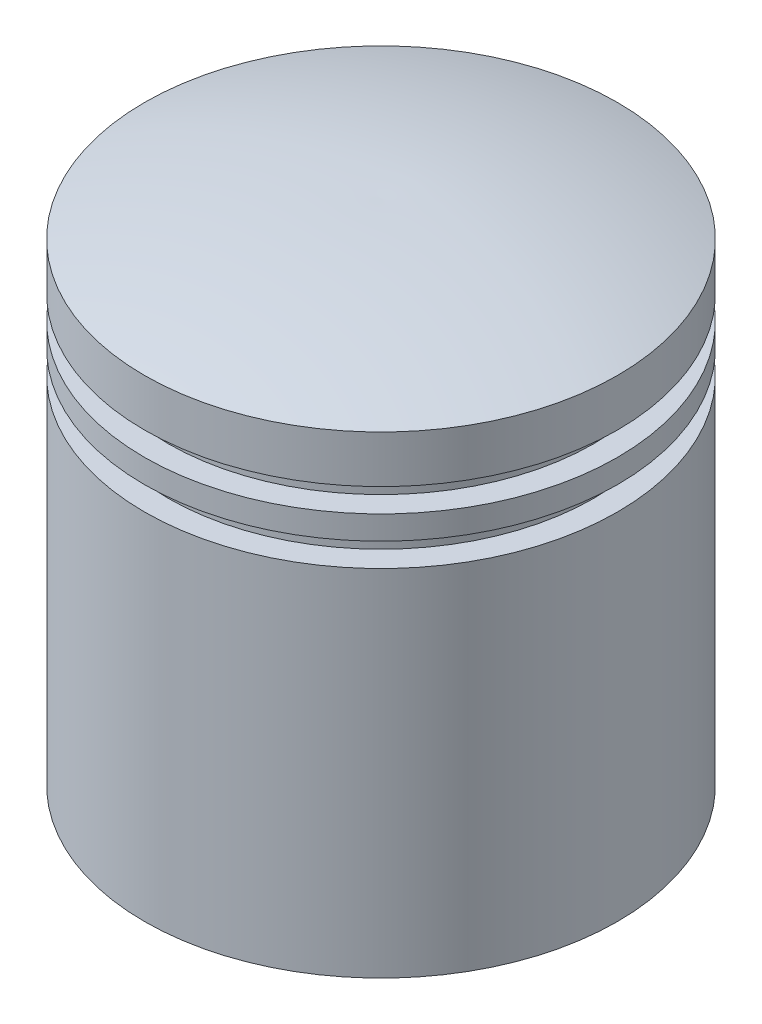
ISO-10303-21;
HEADER;
FILE_DESCRIPTION(('STEP AP214'),'2;1');
FILE_NAME('part.step','',(''),(''),'','','');
FILE_SCHEMA(('AUTOMOTIVE_DESIGN { 1 0 10303 214 1 1 1 1 }'));
ENDSEC;
DATA;
#1=APPLICATION_CONTEXT('core data for automotive mechanical design processes');
#2=APPLICATION_PROTOCOL_DEFINITION('international standard','automotive_design',2000,#1);
#3=PRODUCT_CONTEXT('',#1,'mechanical');
#4=PRODUCT('Part','Part','',(#3));
#5=PRODUCT_RELATED_PRODUCT_CATEGORY('part','',(#4));
#6=PRODUCT_DEFINITION_FORMATION('','',#4);
#7=PRODUCT_DEFINITION_CONTEXT('part definition',#1,'design');
#8=PRODUCT_DEFINITION('design','',#6,#7);
#9=PRODUCT_DEFINITION_SHAPE('','',#8);
#10=(LENGTH_UNIT() NAMED_UNIT(*) SI_UNIT(.MILLI.,.METRE.));
#11=(NAMED_UNIT(*) PLANE_ANGLE_UNIT() SI_UNIT($,.RADIAN.));
#12=(NAMED_UNIT(*) SI_UNIT($,.STERADIAN.) SOLID_ANGLE_UNIT());
#13=UNCERTAINTY_MEASURE_WITH_UNIT(LENGTH_MEASURE(1.E-05),#10,'distance_accuracy_value','');
#14=(GEOMETRIC_REPRESENTATION_CONTEXT(3) GLOBAL_UNCERTAINTY_ASSIGNED_CONTEXT((#13)) GLOBAL_UNIT_ASSIGNED_CONTEXT((#10,
#11,#12)) REPRESENTATION_CONTEXT('',''));
#15=CARTESIAN_POINT('',(0.,0.,0.));
#16=DIRECTION('',(0.,0.,1.));
#17=DIRECTION('',(1.,0.,0.));
#18=AXIS2_PLACEMENT_3D('',#15,#16,#17);
#19=CARTESIAN_POINT('',(25.4,0.,0.));
#20=DIRECTION('',(0.,-1.,0.));
#21=DIRECTION('',(0.,0.,-1.));
#22=AXIS2_PLACEMENT_3D('',#19,#20,#21);
#23=PLANE('',#22);
#24=CARTESIAN_POINT('',(0.,0.,0.));
#25=DIRECTION('',(0.,-1.,0.));
#26=DIRECTION('',(0.,0.,-1.));
#27=AXIS2_PLACEMENT_3D('',#24,#25,#26);
#28=CIRCLE('',#27,25.4);
#29=CARTESIAN_POINT('',(0.,0.,-25.4));
#30=VERTEX_POINT('',#29);
#31=EDGE_CURVE('E11',#30,#30,#28,.T.);
#32=ORIENTED_EDGE('',*,*,#31,.T.);
#33=EDGE_LOOP('',(#32));
#34=FACE_BOUND('',#33,.T.);
#35=CARTESIAN_POINT('',(0.,0.,0.));
#36=DIRECTION('',(0.,-1.,0.));
#37=DIRECTION('',(0.,0.,-1.));
#38=AXIS2_PLACEMENT_3D('',#35,#36,#37);
#39=CIRCLE('',#38,20.955);
#40=CARTESIAN_POINT('',(0.,0.,-20.955));
#41=VERTEX_POINT('',#40);
#42=EDGE_CURVE('E128',#41,#41,#39,.T.);
#43=ORIENTED_EDGE('',*,*,#42,.F.);
#44=EDGE_LOOP('',(#43));
#45=FACE_BOUND('',#44,.T.);
#46=ADVANCED_FACE('F45',(#34,#45),#23,.T.);
#47=CARTESIAN_POINT('',(0.,0.,0.));
#48=DIRECTION('',(0.,-1.,0.));
#49=DIRECTION('',(0.,0.,-1.));
#50=AXIS2_PLACEMENT_3D('',#47,#48,#49);
#51=CYLINDRICAL_SURFACE('',#50,25.4);
#52=CARTESIAN_POINT('',(0.,38.1,0.));
#53=DIRECTION('',(0.,-1.,0.));
#54=DIRECTION('',(0.,0.,-1.));
#55=AXIS2_PLACEMENT_3D('',#52,#53,#54);
#56=CIRCLE('',#55,25.4);
#57=CARTESIAN_POINT('',(0.,38.1,-25.4));
#58=VERTEX_POINT('',#57);
#59=EDGE_CURVE('E52',#58,#58,#56,.T.);
#60=ORIENTED_EDGE('',*,*,#59,.T.);
#61=EDGE_LOOP('',(#60));
#62=FACE_BOUND('',#61,.T.);
#63=ORIENTED_EDGE('',*,*,#31,.F.);
#64=EDGE_LOOP('',(#63));
#65=FACE_BOUND('',#64,.T.);
#66=ADVANCED_FACE('F105',(#62,#65),#51,.T.);
#67=CARTESIAN_POINT('',(25.4,38.1,0.));
#68=DIRECTION('',(0.,1.,0.));
#69=DIRECTION('',(0.,0.,1.));
#70=AXIS2_PLACEMENT_3D('',#67,#68,#69);
#71=PLANE('',#70);
#72=CARTESIAN_POINT('',(0.,38.1,0.));
#73=DIRECTION('',(0.,-1.,0.));
#74=DIRECTION('',(0.,0.,-1.));
#75=AXIS2_PLACEMENT_3D('',#72,#73,#74);
#76=CIRCLE('',#75,22.86);
#77=CARTESIAN_POINT('',(0.,38.1,-22.86));
#78=VERTEX_POINT('',#77);
#79=EDGE_CURVE('E98',#78,#78,#76,.T.);
#80=ORIENTED_EDGE('',*,*,#79,.T.);
#81=EDGE_LOOP('',(#80));
#82=FACE_BOUND('',#81,.T.);
#83=ORIENTED_EDGE('',*,*,#59,.F.);
#84=EDGE_LOOP('',(#83));
#85=FACE_BOUND('',#84,.T.);
#86=ADVANCED_FACE('F108',(#82,#85),#71,.T.);
#87=CARTESIAN_POINT('',(0.,0.,0.));
#88=DIRECTION('',(0.,-1.,0.));
#89=DIRECTION('',(0.,0.,-1.));
#90=AXIS2_PLACEMENT_3D('',#87,#88,#89);
#91=CYLINDRICAL_SURFACE('',#90,22.86);
#92=CARTESIAN_POINT('',(0.,40.64,0.));
#93=DIRECTION('',(0.,-1.,0.));
#94=DIRECTION('',(0.,0.,-1.));
#95=AXIS2_PLACEMENT_3D('',#92,#93,#94);
#96=CIRCLE('',#95,22.86);
#97=CARTESIAN_POINT('',(0.,40.64,-22.86));
#98=VERTEX_POINT('',#97);
#99=EDGE_CURVE('E94',#98,#98,#96,.T.);
#100=ORIENTED_EDGE('',*,*,#99,.T.);
#101=EDGE_LOOP('',(#100));
#102=FACE_BOUND('',#101,.T.);
#103=ORIENTED_EDGE('',*,*,#79,.F.);
#104=EDGE_LOOP('',(#103));
#105=FACE_BOUND('',#104,.T.);
#106=ADVANCED_FACE('F110',(#102,#105),#91,.T.);
#107=CARTESIAN_POINT('',(22.86,40.64,0.));
#108=DIRECTION('',(0.,-1.,0.));
#109=DIRECTION('',(0.,0.,-1.));
#110=AXIS2_PLACEMENT_3D('',#107,#108,#109);
#111=PLANE('',#110);
#112=CARTESIAN_POINT('',(0.,40.64,0.));
#113=DIRECTION('',(0.,-1.,0.));
#114=DIRECTION('',(0.,0.,-1.));
#115=AXIS2_PLACEMENT_3D('',#112,#113,#114);
#116=CIRCLE('',#115,25.4);
#117=CARTESIAN_POINT('',(0.,40.64,-25.4));
#118=VERTEX_POINT('',#117);
#119=EDGE_CURVE('E90',#118,#118,#116,.T.);
#120=ORIENTED_EDGE('',*,*,#119,.T.);
#121=EDGE_LOOP('',(#120));
#122=FACE_BOUND('',#121,.T.);
#123=ORIENTED_EDGE('',*,*,#99,.F.);
#124=EDGE_LOOP('',(#123));
#125=FACE_BOUND('',#124,.T.);
#126=ADVANCED_FACE('F117',(#122,#125),#111,.T.);
#127=CARTESIAN_POINT('',(0.,0.,0.));
#128=DIRECTION('',(0.,-1.,0.));
#129=DIRECTION('',(0.,0.,-1.));
#130=AXIS2_PLACEMENT_3D('',#127,#128,#129);
#131=CYLINDRICAL_SURFACE('',#130,25.4);
#132=CARTESIAN_POINT('',(0.,43.18,0.));
#133=DIRECTION('',(0.,-1.,0.));
#134=DIRECTION('',(0.,0.,-1.));
#135=AXIS2_PLACEMENT_3D('',#132,#133,#134);
#136=CIRCLE('',#135,25.4);
#137=CARTESIAN_POINT('',(0.,43.18,-25.4));
#138=VERTEX_POINT('',#137);
#139=EDGE_CURVE('E86',#138,#138,#136,.T.);
#140=ORIENTED_EDGE('',*,*,#139,.T.);
#141=EDGE_LOOP('',(#140));
#142=FACE_BOUND('',#141,.T.);
#143=ORIENTED_EDGE('',*,*,#119,.F.);
#144=EDGE_LOOP('',(#143));
#145=FACE_BOUND('',#144,.T.);
#146=ADVANCED_FACE('F171',(#142,#145),#131,.T.);
#147=CARTESIAN_POINT('',(25.4,43.18,0.));
#148=DIRECTION('',(0.,1.,0.));
#149=DIRECTION('',(0.,0.,1.));
#150=AXIS2_PLACEMENT_3D('',#147,#148,#149);
#151=PLANE('',#150);
#152=CARTESIAN_POINT('',(0.,43.18,0.));
#153=DIRECTION('',(0.,-1.,0.));
#154=DIRECTION('',(0.,0.,-1.));
#155=AXIS2_PLACEMENT_3D('',#152,#153,#154);
#156=CIRCLE('',#155,22.86);
#157=CARTESIAN_POINT('',(0.,43.18,-22.86));
#158=VERTEX_POINT('',#157);
#159=EDGE_CURVE('E82',#158,#158,#156,.T.);
#160=ORIENTED_EDGE('',*,*,#159,.T.);
#161=EDGE_LOOP('',(#160));
#162=FACE_BOUND('',#161,.T.);
#163=ORIENTED_EDGE('',*,*,#139,.F.);
#164=EDGE_LOOP('',(#163));
#165=FACE_BOUND('',#164,.T.);
#166=ADVANCED_FACE('F167',(#162,#165),#151,.T.);
#167=CARTESIAN_POINT('',(0.,0.,0.));
#168=DIRECTION('',(0.,-1.,0.));
#169=DIRECTION('',(0.,0.,-1.));
#170=AXIS2_PLACEMENT_3D('',#167,#168,#169);
#171=CYLINDRICAL_SURFACE('',#170,22.86);
#172=CARTESIAN_POINT('',(0.,45.72,0.));
#173=DIRECTION('',(0.,-1.,0.));
#174=DIRECTION('',(0.,0.,-1.));
#175=AXIS2_PLACEMENT_3D('',#172,#173,#174);
#176=CIRCLE('',#175,22.86);
#177=CARTESIAN_POINT('',(0.,45.72,-22.86));
#178=VERTEX_POINT('',#177);
#179=EDGE_CURVE('E72',#178,#178,#176,.T.);
#180=ORIENTED_EDGE('',*,*,#179,.T.);
#181=EDGE_LOOP('',(#180));
#182=FACE_BOUND('',#181,.T.);
#183=ORIENTED_EDGE('',*,*,#159,.F.);
#184=EDGE_LOOP('',(#183));
#185=FACE_BOUND('',#184,.T.);
#186=ADVANCED_FACE('F163',(#182,#185),#171,.T.);
#187=CARTESIAN_POINT('',(22.86,45.72,0.));
#188=DIRECTION('',(0.,-1.,0.));
#189=DIRECTION('',(0.,0.,-1.));
#190=AXIS2_PLACEMENT_3D('',#187,#188,#189);
#191=PLANE('',#190);
#192=CARTESIAN_POINT('',(0.,45.72,0.));
#193=DIRECTION('',(0.,-1.,0.));
#194=DIRECTION('',(0.,0.,-1.));
#195=AXIS2_PLACEMENT_3D('',#192,#193,#194);
#196=CIRCLE('',#195,25.4);
#197=CARTESIAN_POINT('',(0.,45.72,-25.4));
#198=VERTEX_POINT('',#197);
#199=EDGE_CURVE('E66',#198,#198,#196,.T.);
#200=ORIENTED_EDGE('',*,*,#199,.T.);
#201=EDGE_LOOP('',(#200));
#202=FACE_BOUND('',#201,.T.);
#203=ORIENTED_EDGE('',*,*,#179,.F.);
#204=EDGE_LOOP('',(#203));
#205=FACE_BOUND('',#204,.T.);
#206=ADVANCED_FACE('F160',(#202,#205),#191,.T.);
#207=CARTESIAN_POINT('',(0.,0.,0.));
#208=DIRECTION('',(0.,-1.,0.));
#209=DIRECTION('',(0.,0.,-1.));
#210=AXIS2_PLACEMENT_3D('',#207,#208,#209);
#211=CYLINDRICAL_SURFACE('',#210,25.4);
#212=CARTESIAN_POINT('',(0.,50.8,0.));
#213=DIRECTION('',(0.,-1.,0.));
#214=DIRECTION('',(0.,0.,-1.));
#215=AXIS2_PLACEMENT_3D('',#212,#213,#214);
#216=CIRCLE('',#215,25.4);
#217=CARTESIAN_POINT('',(0.,50.8,-25.4));
#218=VERTEX_POINT('',#217);
#219=EDGE_CURVE('E63',#218,#218,#216,.T.);
#220=ORIENTED_EDGE('',*,*,#219,.T.);
#221=EDGE_LOOP('',(#220));
#222=FACE_BOUND('',#221,.T.);
#223=ORIENTED_EDGE('',*,*,#199,.F.);
#224=EDGE_LOOP('',(#223));
#225=FACE_BOUND('',#224,.T.);
#226=ADVANCED_FACE('F59',(#222,#225),#211,.T.);
#227=CARTESIAN_POINT('',(0.,-21.5740678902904,-1.55813981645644));
#228=DIRECTION('',(-1.,0.,0.));
#229=DIRECTION('',(0.,0.,-1.));
#230=AXIS2_PLACEMENT_3D('',#227,#228,#229);
#231=CIRCLE('',#230,76.2);
#232=TRIMMED_CURVE('',#231,(PARAMETER_VALUE(-1.59124578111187)),
(PARAMETER_VALUE(1.59124578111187)),.T.,.PARAMETER.);
#233=CARTESIAN_POINT('',(0.,-21.5740678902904,0.));
#234=DIRECTION('',(0.,-1.,0.));
#235=AXIS1_PLACEMENT('',#233,#234);
#236=SURFACE_OF_REVOLUTION('',#232,#235);
#237=CARTESIAN_POINT('',(0.,54.61,0.));
#238=VERTEX_POINT('',#237);
#239=VERTEX_LOOP('',#238);
#240=FACE_BOUND('',#239,.T.);
#241=ORIENTED_EDGE('',*,*,#219,.F.);
#242=EDGE_LOOP('',(#241));
#243=FACE_BOUND('',#242,.T.);
#244=ADVANCED_FACE('F55',(#240,#243),#236,.T.);
#245=CARTESIAN_POINT('',(15.875,44.45,0.));
#246=DIRECTION('',(0.,-1.,0.));
#247=DIRECTION('',(0.,0.,-1.));
#248=AXIS2_PLACEMENT_3D('',#245,#246,#247);
#249=PLANE('',#248);
#250=CARTESIAN_POINT('',(0.,44.45,0.));
#251=DIRECTION('',(0.,-1.,0.));
#252=DIRECTION('',(0.,0.,-1.));
#253=AXIS2_PLACEMENT_3D('',#250,#251,#252);
#254=CIRCLE('',#253,15.875);
#255=CARTESIAN_POINT('',(0.,44.45,-15.875));
#256=VERTEX_POINT('',#255);
#257=EDGE_CURVE('E67',#256,#256,#254,.T.);
#258=ORIENTED_EDGE('',*,*,#257,.T.);
#259=EDGE_LOOP('',(#258));
#260=FACE_BOUND('',#259,.T.);
#261=ADVANCED_FACE('F58',(#260),#249,.T.);
#262=CARTESIAN_POINT('',(0.,0.,0.));
#263=DIRECTION('',(0.,-1.,0.));
#264=DIRECTION('',(0.,0.,-1.));
#265=AXIS2_PLACEMENT_3D('',#262,#263,#264);
#266=CYLINDRICAL_SURFACE('',#265,15.875);
#267=CARTESIAN_POINT('',(0.,19.05,0.));
#268=DIRECTION('',(0.,-1.,0.));
#269=DIRECTION('',(0.,0.,-1.));
#270=AXIS2_PLACEMENT_3D('',#267,#268,#269);
#271=CIRCLE('',#270,15.875);
#272=CARTESIAN_POINT('',(0.,19.05,-15.875));
#273=VERTEX_POINT('',#272);
#274=EDGE_CURVE('E75',#273,#273,#271,.T.);
#275=ORIENTED_EDGE('',*,*,#274,.T.);
#276=EDGE_LOOP('',(#275));
#277=FACE_BOUND('',#276,.T.);
#278=ORIENTED_EDGE('',*,*,#257,.F.);
#279=EDGE_LOOP('',(#278));
#280=FACE_BOUND('',#279,.T.);
#281=ADVANCED_FACE('F140',(#277,#280),#266,.F.);
#282=CARTESIAN_POINT('',(20.955,19.05,0.));
#283=DIRECTION('',(0.,-1.,0.));
#284=DIRECTION('',(0.,0.,-1.));
#285=AXIS2_PLACEMENT_3D('',#282,#283,#284);
#286=PLANE('',#285);
#287=CARTESIAN_POINT('',(0.,19.05,0.));
#288=DIRECTION('',(0.,-1.,0.));
#289=DIRECTION('',(0.,0.,-1.));
#290=AXIS2_PLACEMENT_3D('',#287,#288,#289);
#291=CIRCLE('',#290,20.955);
#292=CARTESIAN_POINT('',(0.,19.05,-20.955));
#293=VERTEX_POINT('',#292);
#294=EDGE_CURVE('E131',#293,#293,#291,.T.);
#295=ORIENTED_EDGE('',*,*,#294,.T.);
#296=EDGE_LOOP('',(#295));
#297=FACE_BOUND('',#296,.T.);
#298=ORIENTED_EDGE('',*,*,#274,.F.);
#299=EDGE_LOOP('',(#298));
#300=FACE_BOUND('',#299,.T.);
#301=ADVANCED_FACE('F143',(#297,#300),#286,.T.);
#302=CARTESIAN_POINT('',(0.,0.,0.));
#303=DIRECTION('',(0.,-1.,0.));
#304=DIRECTION('',(0.,0.,-1.));
#305=AXIS2_PLACEMENT_3D('',#302,#303,#304);
#306=CYLINDRICAL_SURFACE('',#305,20.955);
#307=ORIENTED_EDGE('',*,*,#42,.T.);
#308=EDGE_LOOP('',(#307));
#309=FACE_BOUND('',#308,.T.);
#310=ORIENTED_EDGE('',*,*,#294,.F.);
#311=EDGE_LOOP('',(#310));
#312=FACE_BOUND('',#311,.T.);
#313=ADVANCED_FACE('F145',(#309,#312),#306,.F.);
#314=CLOSED_SHELL('',(#46,#66,#86,#106,#126,#146,#166,#186,#206,#226,#244,#261,#281,#301,#313));
#315=MANIFOLD_SOLID_BREP('B2',#314);
#316=ADVANCED_BREP_SHAPE_REPRESENTATION('',(#18,#315),#14);
#317=SHAPE_DEFINITION_REPRESENTATION(#9,#316);
ENDSEC;
END-ISO-10303-21;
